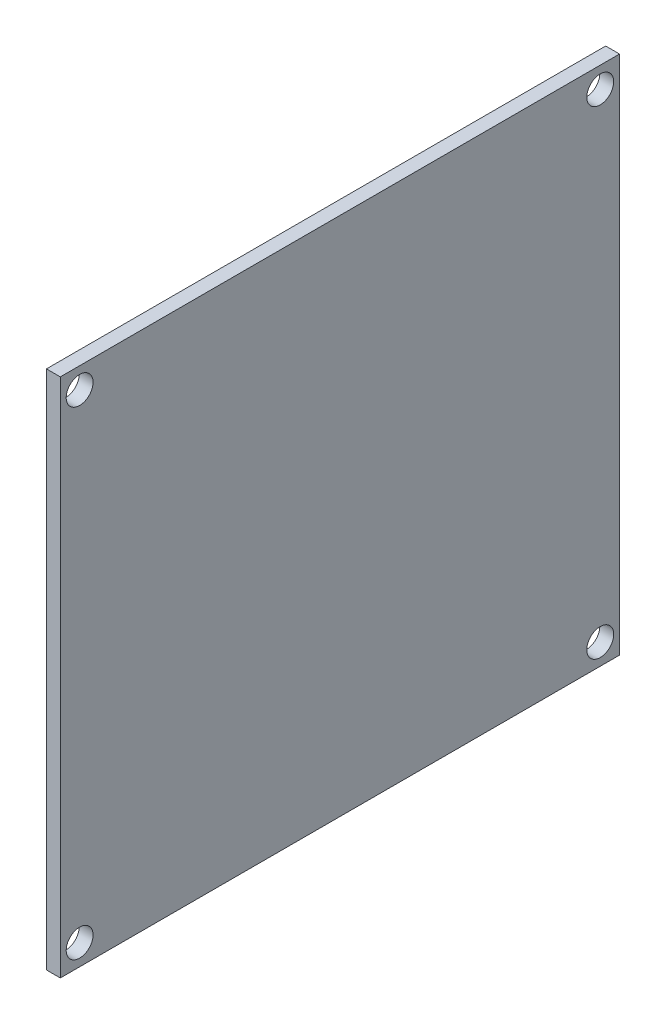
ISO-10303-21;
HEADER;
FILE_DESCRIPTION(('STEP AP214'),'2;1');
FILE_NAME('part.step','',(''),(''),'','','');
FILE_SCHEMA(('AUTOMOTIVE_DESIGN { 1 0 10303 214 1 1 1 1 }'));
ENDSEC;
DATA;
#1=APPLICATION_CONTEXT('core data for automotive mechanical design processes');
#2=APPLICATION_PROTOCOL_DEFINITION('international standard','automotive_design',2000,#1);
#3=PRODUCT_CONTEXT('',#1,'mechanical');
#4=PRODUCT('Part','Part','',(#3));
#5=PRODUCT_RELATED_PRODUCT_CATEGORY('part','',(#4));
#6=PRODUCT_DEFINITION_FORMATION('','',#4);
#7=PRODUCT_DEFINITION_CONTEXT('part definition',#1,'design');
#8=PRODUCT_DEFINITION('design','',#6,#7);
#9=PRODUCT_DEFINITION_SHAPE('','',#8);
#10=(LENGTH_UNIT() NAMED_UNIT(*) SI_UNIT(.MILLI.,.METRE.));
#11=(NAMED_UNIT(*) PLANE_ANGLE_UNIT() SI_UNIT($,.RADIAN.));
#12=(NAMED_UNIT(*) SI_UNIT($,.STERADIAN.) SOLID_ANGLE_UNIT());
#13=UNCERTAINTY_MEASURE_WITH_UNIT(LENGTH_MEASURE(1.E-05),#10,'distance_accuracy_value','');
#14=(GEOMETRIC_REPRESENTATION_CONTEXT(3) GLOBAL_UNCERTAINTY_ASSIGNED_CONTEXT((#13)) GLOBAL_UNIT_ASSIGNED_CONTEXT((#10,
#11,#12)) REPRESENTATION_CONTEXT('',''));
#15=CARTESIAN_POINT('',(0.,0.,0.));
#16=DIRECTION('',(0.,0.,1.));
#17=DIRECTION('',(1.,0.,0.));
#18=AXIS2_PLACEMENT_3D('',#15,#16,#17);
#19=CARTESIAN_POINT('',(1.65,0.,0.));
#20=DIRECTION('',(1.,0.,0.));
#21=DIRECTION('',(0.,0.,-1.));
#22=AXIS2_PLACEMENT_3D('',#19,#20,#21);
#23=PLANE('',#22);
#24=CARTESIAN_POINT('',(1.65,-28.5,-31.));
#25=DIRECTION('',(1.,0.,0.));
#26=DIRECTION('',(0.,0.,-1.));
#27=AXIS2_PLACEMENT_3D('',#24,#25,#26);
#28=CIRCLE('',#27,1.6);
#29=CARTESIAN_POINT('',(1.65,-28.5,-32.6));
#30=VERTEX_POINT('',#29);
#31=EDGE_CURVE('E122',#30,#30,#28,.T.);
#32=ORIENTED_EDGE('',*,*,#31,.F.);
#33=EDGE_LOOP('',(#32));
#34=FACE_BOUND('',#33,.T.);
#35=CARTESIAN_POINT('',(1.65,28.5,-31.));
#36=DIRECTION('',(1.,0.,0.));
#37=DIRECTION('',(0.,0.,1.));
#38=AXIS2_PLACEMENT_3D('',#35,#36,#37);
#39=CIRCLE('',#38,1.6);
#40=CARTESIAN_POINT('',(1.65,28.5,-29.4));
#41=VERTEX_POINT('',#40);
#42=EDGE_CURVE('E101',#41,#41,#39,.T.);
#43=ORIENTED_EDGE('',*,*,#42,.F.);
#44=EDGE_LOOP('',(#43));
#45=FACE_BOUND('',#44,.T.);
#46=DIRECTION('',(0.,1.,0.));
#47=VECTOR('',#46,1.);
#48=CARTESIAN_POINT('',(1.65,31.,-33.3));
#49=LINE('',#48,#47);
#50=CARTESIAN_POINT('',(1.65,-31.,-33.3));
#51=VERTEX_POINT('',#50);
#52=CARTESIAN_POINT('',(1.65,31.,-33.3));
#53=VERTEX_POINT('',#52);
#54=EDGE_CURVE('E86',#51,#53,#49,.T.);
#55=ORIENTED_EDGE('',*,*,#54,.T.);
#56=DIRECTION('',(0.,0.,1.));
#57=VECTOR('',#56,1.);
#58=CARTESIAN_POINT('',(1.65,31.,33.3));
#59=LINE('',#58,#57);
#60=CARTESIAN_POINT('',(1.65,31.,33.3));
#61=VERTEX_POINT('',#60);
#62=EDGE_CURVE('E81',#53,#61,#59,.T.);
#63=ORIENTED_EDGE('',*,*,#62,.T.);
#64=DIRECTION('',(0.,-1.,0.));
#65=VECTOR('',#64,1.);
#66=CARTESIAN_POINT('',(1.65,31.,33.3));
#67=LINE('',#66,#65);
#68=CARTESIAN_POINT('',(1.65,-31.,33.3));
#69=VERTEX_POINT('',#68);
#70=EDGE_CURVE('E84',#61,#69,#67,.T.);
#71=ORIENTED_EDGE('',*,*,#70,.T.);
#72=DIRECTION('',(0.,0.,-1.));
#73=VECTOR('',#72,1.);
#74=CARTESIAN_POINT('',(1.65,-31.,33.3));
#75=LINE('',#74,#73);
#76=EDGE_CURVE('E51',#69,#51,#75,.T.);
#77=ORIENTED_EDGE('',*,*,#76,.T.);
#78=EDGE_LOOP('',(#55,#63,#71,#77));
#79=FACE_BOUND('',#78,.T.);
#80=CARTESIAN_POINT('',(1.65,28.5,31.));
#81=DIRECTION('',(1.,0.,0.));
#82=DIRECTION('',(0.,0.,-1.));
#83=AXIS2_PLACEMENT_3D('',#80,#81,#82);
#84=CIRCLE('',#83,1.6);
#85=CARTESIAN_POINT('',(1.65,28.5,29.4));
#86=VERTEX_POINT('',#85);
#87=EDGE_CURVE('E116',#86,#86,#84,.T.);
#88=ORIENTED_EDGE('',*,*,#87,.F.);
#89=EDGE_LOOP('',(#88));
#90=FACE_BOUND('',#89,.T.);
#91=CARTESIAN_POINT('',(1.65,-28.5,31.));
#92=DIRECTION('',(1.,0.,0.));
#93=DIRECTION('',(0.,0.,1.));
#94=AXIS2_PLACEMENT_3D('',#91,#92,#93);
#95=CIRCLE('',#94,1.6);
#96=CARTESIAN_POINT('',(1.65,-28.5,32.6));
#97=VERTEX_POINT('',#96);
#98=EDGE_CURVE('E128',#97,#97,#95,.T.);
#99=ORIENTED_EDGE('',*,*,#98,.F.);
#100=EDGE_LOOP('',(#99));
#101=FACE_BOUND('',#100,.T.);
#102=ADVANCED_FACE('F34',(#34,#45,#79,#90,#101),#23,.T.);
#103=CARTESIAN_POINT('',(0.,0.,0.));
#104=DIRECTION('',(1.,0.,0.));
#105=DIRECTION('',(0.,0.,-1.));
#106=AXIS2_PLACEMENT_3D('',#103,#104,#105);
#107=PLANE('',#106);
#108=CARTESIAN_POINT('',(0.,-28.5,-31.));
#109=DIRECTION('',(1.,0.,0.));
#110=DIRECTION('',(0.,0.,-1.));
#111=AXIS2_PLACEMENT_3D('',#108,#109,#110);
#112=CIRCLE('',#111,1.6);
#113=CARTESIAN_POINT('',(0.,-28.5,-32.6));
#114=VERTEX_POINT('',#113);
#115=EDGE_CURVE('E125',#114,#114,#112,.T.);
#116=ORIENTED_EDGE('',*,*,#115,.T.);
#117=EDGE_LOOP('',(#116));
#118=FACE_BOUND('',#117,.T.);
#119=CARTESIAN_POINT('',(0.,28.5,-31.));
#120=DIRECTION('',(1.,0.,0.));
#121=DIRECTION('',(0.,0.,1.));
#122=AXIS2_PLACEMENT_3D('',#119,#120,#121);
#123=CIRCLE('',#122,1.6);
#124=CARTESIAN_POINT('',(0.,28.5,-29.4));
#125=VERTEX_POINT('',#124);
#126=EDGE_CURVE('E113',#125,#125,#123,.T.);
#127=ORIENTED_EDGE('',*,*,#126,.T.);
#128=EDGE_LOOP('',(#127));
#129=FACE_BOUND('',#128,.T.);
#130=DIRECTION('',(0.,1.,0.));
#131=VECTOR('',#130,1.);
#132=CARTESIAN_POINT('',(0.,31.,-33.3));
#133=LINE('',#132,#131);
#134=CARTESIAN_POINT('',(0.,-31.,-33.3));
#135=VERTEX_POINT('',#134);
#136=CARTESIAN_POINT('',(0.,31.,-33.3));
#137=VERTEX_POINT('',#136);
#138=EDGE_CURVE('E98',#135,#137,#133,.T.);
#139=ORIENTED_EDGE('',*,*,#138,.F.);
#140=DIRECTION('',(0.,0.,-1.));
#141=VECTOR('',#140,1.);
#142=CARTESIAN_POINT('',(0.,-31.,33.3));
#143=LINE('',#142,#141);
#144=CARTESIAN_POINT('',(0.,-31.,33.3));
#145=VERTEX_POINT('',#144);
#146=EDGE_CURVE('E74',#145,#135,#143,.T.);
#147=ORIENTED_EDGE('',*,*,#146,.F.);
#148=DIRECTION('',(0.,-1.,0.));
#149=VECTOR('',#148,1.);
#150=CARTESIAN_POINT('',(0.,31.,33.3));
#151=LINE('',#150,#149);
#152=CARTESIAN_POINT('',(0.,31.,33.3));
#153=VERTEX_POINT('',#152);
#154=EDGE_CURVE('E68',#153,#145,#151,.T.);
#155=ORIENTED_EDGE('',*,*,#154,.F.);
#156=DIRECTION('',(0.,0.,1.));
#157=VECTOR('',#156,1.);
#158=CARTESIAN_POINT('',(0.,31.,33.3));
#159=LINE('',#158,#157);
#160=EDGE_CURVE('E90',#137,#153,#159,.T.);
#161=ORIENTED_EDGE('',*,*,#160,.F.);
#162=EDGE_LOOP('',(#139,#147,#155,#161));
#163=FACE_BOUND('',#162,.T.);
#164=CARTESIAN_POINT('',(0.,28.5,31.));
#165=DIRECTION('',(1.,0.,0.));
#166=DIRECTION('',(0.,0.,-1.));
#167=AXIS2_PLACEMENT_3D('',#164,#165,#166);
#168=CIRCLE('',#167,1.6);
#169=CARTESIAN_POINT('',(0.,28.5,29.4));
#170=VERTEX_POINT('',#169);
#171=EDGE_CURVE('E119',#170,#170,#168,.T.);
#172=ORIENTED_EDGE('',*,*,#171,.T.);
#173=EDGE_LOOP('',(#172));
#174=FACE_BOUND('',#173,.T.);
#175=CARTESIAN_POINT('',(0.,-28.5,31.));
#176=DIRECTION('',(1.,0.,0.));
#177=DIRECTION('',(0.,0.,1.));
#178=AXIS2_PLACEMENT_3D('',#175,#176,#177);
#179=CIRCLE('',#178,1.6);
#180=CARTESIAN_POINT('',(0.,-28.5,32.6));
#181=VERTEX_POINT('',#180);
#182=EDGE_CURVE('E131',#181,#181,#179,.T.);
#183=ORIENTED_EDGE('',*,*,#182,.T.);
#184=EDGE_LOOP('',(#183));
#185=FACE_BOUND('',#184,.T.);
#186=ADVANCED_FACE('F109',(#118,#129,#163,#174,#185),#107,.F.);
#187=CARTESIAN_POINT('',(1.65,31.,-33.3));
#188=DIRECTION('',(0.,0.,1.));
#189=DIRECTION('',(1.,0.,0.));
#190=AXIS2_PLACEMENT_3D('',#187,#188,#189);
#191=PLANE('',#190);
#192=ORIENTED_EDGE('',*,*,#138,.T.);
#193=DIRECTION('',(-1.,0.,0.));
#194=VECTOR('',#193,1.);
#195=CARTESIAN_POINT('',(1.65,31.,-33.3));
#196=LINE('',#195,#194);
#197=EDGE_CURVE('E11',#53,#137,#196,.T.);
#198=ORIENTED_EDGE('',*,*,#197,.F.);
#199=ORIENTED_EDGE('',*,*,#54,.F.);
#200=DIRECTION('',(-1.,0.,0.));
#201=VECTOR('',#200,1.);
#202=CARTESIAN_POINT('',(1.65,-31.,-33.3));
#203=LINE('',#202,#201);
#204=EDGE_CURVE('E94',#51,#135,#203,.T.);
#205=ORIENTED_EDGE('',*,*,#204,.T.);
#206=EDGE_LOOP('',(#192,#198,#199,#205));
#207=FACE_BOUND('',#206,.T.);
#208=ADVANCED_FACE('F36',(#207),#191,.F.);
#209=CARTESIAN_POINT('',(1.65,31.,33.3));
#210=DIRECTION('',(0.,-1.,0.));
#211=DIRECTION('',(0.,0.,-1.));
#212=AXIS2_PLACEMENT_3D('',#209,#210,#211);
#213=PLANE('',#212);
#214=ORIENTED_EDGE('',*,*,#160,.T.);
#215=DIRECTION('',(-1.,0.,0.));
#216=VECTOR('',#215,1.);
#217=CARTESIAN_POINT('',(1.65,31.,33.3));
#218=LINE('',#217,#216);
#219=EDGE_CURVE('E43',#61,#153,#218,.T.);
#220=ORIENTED_EDGE('',*,*,#219,.F.);
#221=ORIENTED_EDGE('',*,*,#62,.F.);
#222=ORIENTED_EDGE('',*,*,#197,.T.);
#223=EDGE_LOOP('',(#214,#220,#221,#222));
#224=FACE_BOUND('',#223,.T.);
#225=ADVANCED_FACE('F89',(#224),#213,.F.);
#226=CARTESIAN_POINT('',(1.65,31.,33.3));
#227=DIRECTION('',(0.,0.,-1.));
#228=DIRECTION('',(0.,1.,0.));
#229=AXIS2_PLACEMENT_3D('',#226,#227,#228);
#230=PLANE('',#229);
#231=ORIENTED_EDGE('',*,*,#154,.T.);
#232=DIRECTION('',(-1.,0.,0.));
#233=VECTOR('',#232,1.);
#234=CARTESIAN_POINT('',(1.65,-31.,33.3));
#235=LINE('',#234,#233);
#236=EDGE_CURVE('E91',#69,#145,#235,.T.);
#237=ORIENTED_EDGE('',*,*,#236,.F.);
#238=ORIENTED_EDGE('',*,*,#70,.F.);
#239=ORIENTED_EDGE('',*,*,#219,.T.);
#240=EDGE_LOOP('',(#231,#237,#238,#239));
#241=FACE_BOUND('',#240,.T.);
#242=ADVANCED_FACE('F92',(#241),#230,.F.);
#243=CARTESIAN_POINT('',(1.65,-31.,33.3));
#244=DIRECTION('',(0.,1.,0.));
#245=DIRECTION('',(0.,0.,1.));
#246=AXIS2_PLACEMENT_3D('',#243,#244,#245);
#247=PLANE('',#246);
#248=ORIENTED_EDGE('',*,*,#146,.T.);
#249=ORIENTED_EDGE('',*,*,#204,.F.);
#250=ORIENTED_EDGE('',*,*,#76,.F.);
#251=ORIENTED_EDGE('',*,*,#236,.T.);
#252=EDGE_LOOP('',(#248,#249,#250,#251));
#253=FACE_BOUND('',#252,.T.);
#254=ADVANCED_FACE('F106',(#253),#247,.F.);
#255=CARTESIAN_POINT('',(1.65,28.5,-31.));
#256=DIRECTION('',(-1.,0.,0.));
#257=DIRECTION('',(0.,0.,1.));
#258=AXIS2_PLACEMENT_3D('',#255,#256,#257);
#259=CYLINDRICAL_SURFACE('',#258,1.6);
#260=ORIENTED_EDGE('',*,*,#42,.T.);
#261=EDGE_LOOP('',(#260));
#262=FACE_BOUND('',#261,.T.);
#263=ORIENTED_EDGE('',*,*,#126,.F.);
#264=EDGE_LOOP('',(#263));
#265=FACE_BOUND('',#264,.T.);
#266=ADVANCED_FACE('F151',(#262,#265),#259,.F.);
#267=CARTESIAN_POINT('',(1.65,28.5,31.));
#268=DIRECTION('',(-1.,0.,0.));
#269=DIRECTION('',(0.,0.,1.));
#270=AXIS2_PLACEMENT_3D('',#267,#268,#269);
#271=CYLINDRICAL_SURFACE('',#270,1.6);
#272=ORIENTED_EDGE('',*,*,#87,.T.);
#273=EDGE_LOOP('',(#272));
#274=FACE_BOUND('',#273,.T.);
#275=ORIENTED_EDGE('',*,*,#171,.F.);
#276=EDGE_LOOP('',(#275));
#277=FACE_BOUND('',#276,.T.);
#278=ADVANCED_FACE('F201',(#274,#277),#271,.F.);
#279=CARTESIAN_POINT('',(1.65,-28.5,-31.));
#280=DIRECTION('',(-1.,0.,0.));
#281=DIRECTION('',(0.,0.,1.));
#282=AXIS2_PLACEMENT_3D('',#279,#280,#281);
#283=CYLINDRICAL_SURFACE('',#282,1.6);
#284=ORIENTED_EDGE('',*,*,#31,.T.);
#285=EDGE_LOOP('',(#284));
#286=FACE_BOUND('',#285,.T.);
#287=ORIENTED_EDGE('',*,*,#115,.F.);
#288=EDGE_LOOP('',(#287));
#289=FACE_BOUND('',#288,.T.);
#290=ADVANCED_FACE('F209',(#286,#289),#283,.F.);
#291=CARTESIAN_POINT('',(1.65,-28.5,31.));
#292=DIRECTION('',(-1.,0.,0.));
#293=DIRECTION('',(0.,0.,1.));
#294=AXIS2_PLACEMENT_3D('',#291,#292,#293);
#295=CYLINDRICAL_SURFACE('',#294,1.6);
#296=ORIENTED_EDGE('',*,*,#98,.T.);
#297=EDGE_LOOP('',(#296));
#298=FACE_BOUND('',#297,.T.);
#299=ORIENTED_EDGE('',*,*,#182,.F.);
#300=EDGE_LOOP('',(#299));
#301=FACE_BOUND('',#300,.T.);
#302=ADVANCED_FACE('F137',(#298,#301),#295,.F.);
#303=CLOSED_SHELL('',(#102,#186,#208,#225,#242,#254,#266,#278,#290,#302));
#304=MANIFOLD_SOLID_BREP('B2',#303);
#305=ADVANCED_BREP_SHAPE_REPRESENTATION('',(#18,#304),#14);
#306=SHAPE_DEFINITION_REPRESENTATION(#9,#305);
ENDSEC;
END-ISO-10303-21;
